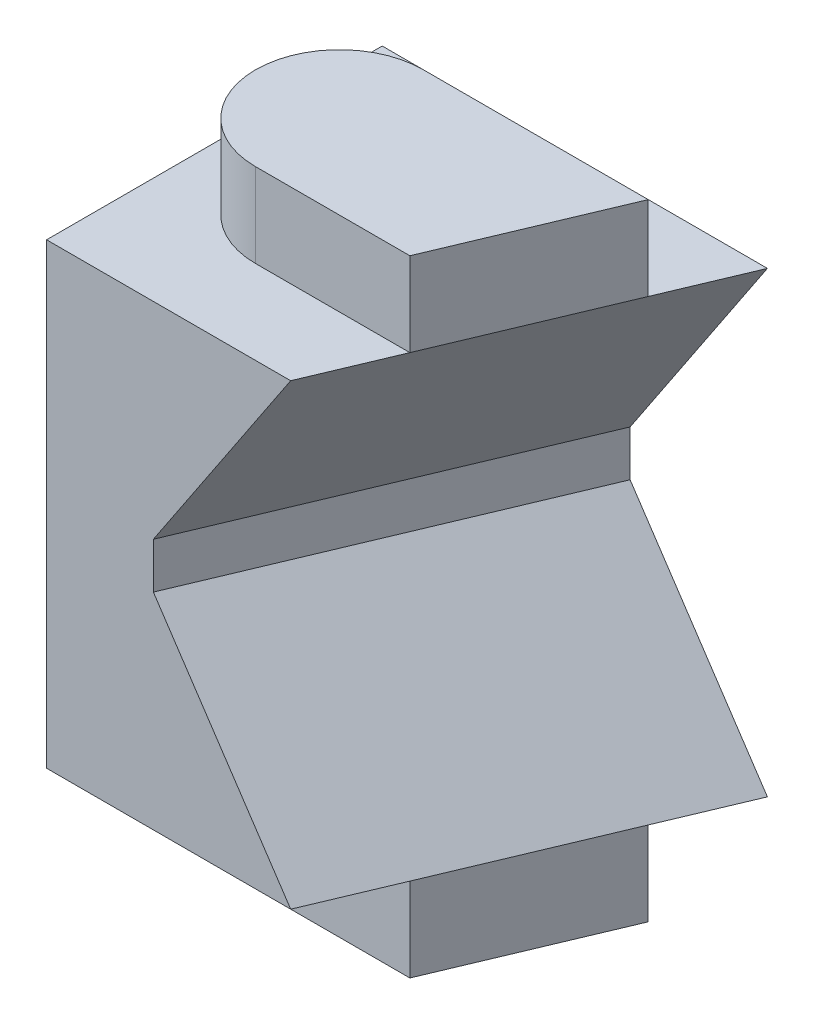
ISO-10303-21;
HEADER;
FILE_DESCRIPTION(('STEP AP214'),'2;1');
FILE_NAME('part.step','',(''),(''),'','','');
FILE_SCHEMA(('AUTOMOTIVE_DESIGN { 1 0 10303 214 1 1 1 1 }'));
ENDSEC;
DATA;
#1=APPLICATION_CONTEXT('core data for automotive mechanical design processes');
#2=APPLICATION_PROTOCOL_DEFINITION('international standard','automotive_design',2000,#1);
#3=PRODUCT_CONTEXT('',#1,'mechanical');
#4=PRODUCT('Part','Part','',(#3));
#5=PRODUCT_RELATED_PRODUCT_CATEGORY('part','',(#4));
#6=PRODUCT_DEFINITION_FORMATION('','',#4);
#7=PRODUCT_DEFINITION_CONTEXT('part definition',#1,'design');
#8=PRODUCT_DEFINITION('design','',#6,#7);
#9=PRODUCT_DEFINITION_SHAPE('','',#8);
#10=(LENGTH_UNIT() NAMED_UNIT(*) SI_UNIT(.MILLI.,.METRE.));
#11=(NAMED_UNIT(*) PLANE_ANGLE_UNIT() SI_UNIT($,.RADIAN.));
#12=(NAMED_UNIT(*) SI_UNIT($,.STERADIAN.) SOLID_ANGLE_UNIT());
#13=UNCERTAINTY_MEASURE_WITH_UNIT(LENGTH_MEASURE(1.E-05),#10,'distance_accuracy_value','');
#14=(GEOMETRIC_REPRESENTATION_CONTEXT(3) GLOBAL_UNCERTAINTY_ASSIGNED_CONTEXT((#13)) GLOBAL_UNIT_ASSIGNED_CONTEXT((#10,
#11,#12)) REPRESENTATION_CONTEXT('',''));
#15=CARTESIAN_POINT('',(0.,0.,0.));
#16=DIRECTION('',(0.,0.,1.));
#17=DIRECTION('',(1.,0.,0.));
#18=AXIS2_PLACEMENT_3D('',#15,#16,#17);
#19=CARTESIAN_POINT('',(15.9999998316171,-15.0000000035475,22.0000000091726));
#20=DIRECTION('',(0.785395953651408,0.523597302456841,0.330150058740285));
#21=DIRECTION('',(-0.554700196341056,0.832050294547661,-4.39613269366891E-13));
#22=AXIS2_PLACEMENT_3D('',#19,#20,#21);
#23=PLANE('',#22);
#24=CARTESIAN_POINT('',(25.2479482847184,-15.0000000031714,1.43924499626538E-09));
#25=CARTESIAN_POINT('',(22.935961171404,-15.0000000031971,5.50000000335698));
#26=B_SPLINE_CURVE_WITH_KNOTS('',1,(#24,#25),.UNSPECIFIED.,.F.,.F.,(2,2),(0.,1.),.UNSPECIFIED.);
#27=CARTESIAN_POINT('',(25.2479482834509,-15.000000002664,4.64784119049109E-10));
#28=VERTEX_POINT('',#27);
#29=CARTESIAN_POINT('',(22.9359611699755,-15.0000000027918,5.50000000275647));
#30=VERTEX_POINT('',#29);
#31=EDGE_CURVE('E205',#28,#30,#26,.T.);
#32=ORIENTED_EDGE('',*,*,#31,.F.);
#33=CARTESIAN_POINT('',(25.2479482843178,-15.0000000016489,-2.24463195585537E-11));
#34=CARTESIAN_POINT('',(16.2479482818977,-1.49999999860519,-1.53148074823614E-11));
#35=B_SPLINE_CURVE_WITH_KNOTS('',1,(#33,#34),.UNSPECIFIED.,.F.,.F.,(2,2),(0.,1.),.UNSPECIFIED.);
#36=CARTESIAN_POINT('',(16.2479482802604,-1.4999996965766,-9.49299120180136E-12));
#37=VERTEX_POINT('',#36);
#38=EDGE_CURVE('E277',#28,#37,#35,.T.);
#39=ORIENTED_EDGE('',*,*,#38,.T.);
#40=CARTESIAN_POINT('',(16.247948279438,-1.49999999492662,2.15064086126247E-12));
#41=CARTESIAN_POINT('',(6.99999982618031,-1.49999999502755,22.0000000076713));
#42=B_SPLINE_CURVE_WITH_KNOTS('',1,(#40,#41),.UNSPECIFIED.,.F.,.F.,(2,2),(0.,1.),.UNSPECIFIED.);
#43=CARTESIAN_POINT('',(6.9999999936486,-1.50000008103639,22.0000000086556));
#44=VERTEX_POINT('',#43);
#45=EDGE_CURVE('E131',#37,#44,#42,.T.);
#46=ORIENTED_EDGE('',*,*,#45,.T.);
#47=CARTESIAN_POINT('',(15.9999998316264,-15.0000000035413,22.0000000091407));
#48=CARTESIAN_POINT('',(6.99999982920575,-1.5000000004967,22.0000000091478));
#49=B_SPLINE_CURVE_WITH_KNOTS('',1,(#47,#48),.UNSPECIFIED.,.F.,.F.,(2,2),(0.,1.),.UNSPECIFIED.);
#50=CARTESIAN_POINT('',(15.9999998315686,-15.0000000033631,22.0000000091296));
#51=VERTEX_POINT('',#50);
#52=EDGE_CURVE('E129',#51,#44,#49,.T.);
#53=ORIENTED_EDGE('',*,*,#52,.F.);
#54=CARTESIAN_POINT('',(18.3119869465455,-15.0000000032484,16.5000000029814));
#55=CARTESIAN_POINT('',(15.9999998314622,-15.000000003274,22.0000000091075));
#56=B_SPLINE_CURVE_WITH_KNOTS('',1,(#54,#55),.UNSPECIFIED.,.F.,.F.,(2,2),(0.,1.),.UNSPECIFIED.);
#57=CARTESIAN_POINT('',(18.3119869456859,-15.0000000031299,16.5000000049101));
#58=VERTEX_POINT('',#57);
#59=EDGE_CURVE('E116',#58,#51,#56,.T.);
#60=ORIENTED_EDGE('',*,*,#59,.F.);
#61=CARTESIAN_POINT('',(22.9359611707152,-15.0000000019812,5.50000000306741));
#62=CARTESIAN_POINT('',(18.3119869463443,-15.0000000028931,16.5000000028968));
#63=B_SPLINE_CURVE_WITH_KNOTS('',1,(#61,#62),.UNSPECIFIED.,.F.,.F.,(2,2),(0.,1.),.UNSPECIFIED.);
#64=EDGE_CURVE('E189',#30,#58,#63,.T.);
#65=ORIENTED_EDGE('',*,*,#64,.F.);
#66=EDGE_LOOP('',(#32,#39,#46,#53,#60,#65));
#67=FACE_BOUND('',#66,.T.);
#68=ADVANCED_FACE('F14',(#67),#23,.T.);
#69=CARTESIAN_POINT('',(4.99999982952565,-15.0000000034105,22.0000000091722));
#70=DIRECTION('',(-1.24066867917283E-11,1.00000000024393,-5.52071956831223E-13));
#71=DIRECTION('',(0.,-5.52016445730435E-13,1.00000000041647));
#72=AXIS2_PLACEMENT_3D('',#69,#70,#71);
#73=PLANE('',#72);
#74=ORIENTED_EDGE('',*,*,#59,.T.);
#75=CARTESIAN_POINT('',(15.9999998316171,-15.000000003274,22.0000000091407));
#76=CARTESIAN_POINT('',(0.390815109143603,-15.0000000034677,22.0000000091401));
#77=B_SPLINE_CURVE_WITH_KNOTS('',1,(#75,#76),.UNSPECIFIED.,.F.,.F.,(2,2),(0.,1.),.UNSPECIFIED.);
#78=CARTESIAN_POINT('',(0.390815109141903,-15.0000000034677,22.0000000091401));
#79=VERTEX_POINT('',#78);
#80=EDGE_CURVE('E120',#51,#79,#77,.T.);
#81=ORIENTED_EDGE('',*,*,#80,.T.);
#82=CARTESIAN_POINT('',(0.390815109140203,-15.0000000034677,22.0000000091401));
#83=CARTESIAN_POINT('',(-1.66666645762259E-07,-15.0000000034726,22.0000000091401));
#84=B_SPLINE_CURVE_WITH_KNOTS('',1,(#82,#83),.UNSPECIFIED.,.F.,.F.,(2,2),(0.,1.),.UNSPECIFIED.);
#85=CARTESIAN_POINT('',(-1.66666645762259E-07,-14.9999998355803,22.0000000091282));
#86=VERTEX_POINT('',#85);
#87=EDGE_CURVE('E139',#79,#86,#84,.T.);
#88=ORIENTED_EDGE('',*,*,#87,.T.);
#89=CARTESIAN_POINT('',(-1.66666645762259E-07,-15.0000000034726,22.0000000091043));
#90=CARTESIAN_POINT('',(-1.66666645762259E-07,-15.0000000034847,-3.71435158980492E-09));
#91=B_SPLINE_CURVE_WITH_KNOTS('',1,(#89,#90),.UNSPECIFIED.,.F.,.F.,(2,2),(0.,1.),.UNSPECIFIED.);
#92=CARTESIAN_POINT('',(0.,-15.0000000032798,-1.25368120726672E-09));
#93=VERTEX_POINT('',#92);
#94=EDGE_CURVE('E126',#86,#93,#91,.T.);
#95=ORIENTED_EDGE('',*,*,#94,.T.);
#96=CARTESIAN_POINT('',(0.390815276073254,-15.0000000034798,-2.33320895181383E-11));
#97=CARTESIAN_POINT('',(-1.66666645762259E-07,-15.0000000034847,-2.33460160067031E-11));
#98=B_SPLINE_CURVE_WITH_KNOTS('',1,(#96,#97),.UNSPECIFIED.,.F.,.F.,(2,2),(0.,1.),.UNSPECIFIED.);
#99=CARTESIAN_POINT('',(0.390815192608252,-15.0000000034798,-2.33320895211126E-11));
#100=VERTEX_POINT('',#99);
#101=EDGE_CURVE('E312',#100,#93,#98,.T.);
#102=ORIENTED_EDGE('',*,*,#101,.F.);
#103=CARTESIAN_POINT('',(25.2479482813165,-15.0000000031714,-2.24463195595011E-11));
#104=CARTESIAN_POINT('',(0.390815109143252,-15.0000000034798,-2.33320895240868E-11));
#105=B_SPLINE_CURVE_WITH_KNOTS('',1,(#103,#104),.UNSPECIFIED.,.F.,.F.,(2,2),(0.,1.),.UNSPECIFIED.);
#106=EDGE_CURVE('E275',#28,#100,#105,.T.);
#107=ORIENTED_EDGE('',*,*,#106,.F.);
#108=ORIENTED_EDGE('',*,*,#31,.T.);
#109=CARTESIAN_POINT('',(8.19540747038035,-15.00000000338,5.50000000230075));
#110=CARTESIAN_POINT('',(22.9359611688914,-15.0000000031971,5.50000000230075));
#111=B_SPLINE_CURVE_WITH_KNOTS('',1,(#109,#110),.UNSPECIFIED.,.F.,.F.,(2,2),(0.,1.),.UNSPECIFIED.);
#112=CARTESIAN_POINT('',(8.1954074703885,-15.00000000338,5.50000000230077));
#113=VERTEX_POINT('',#112);
#114=EDGE_CURVE('E181',#113,#30,#111,.T.);
#115=ORIENTED_EDGE('',*,*,#114,.F.);
#116=CARTESIAN_POINT('',(8.19540747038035,-15.0000000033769,11.000000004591));
#117=DIRECTION('',(-1.24066867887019E-11,1.,-5.52071956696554E-13));
#118=DIRECTION('',(-1.,-1.24066867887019E-11,0.));
#119=AXIS2_PLACEMENT_3D('',#116,#117,#118);
#120=CIRCLE('',#119,5.50000000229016);
#121=CARTESIAN_POINT('',(8.1954074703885,-15.0000000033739,16.5000000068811));
#122=VERTEX_POINT('',#121);
#123=EDGE_CURVE('E179',#113,#122,#120,.T.);
#124=ORIENTED_EDGE('',*,*,#123,.T.);
#125=CARTESIAN_POINT('',(18.3119869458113,-15.0000000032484,16.5000000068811));
#126=CARTESIAN_POINT('',(8.19540747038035,-15.0000000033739,16.5000000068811));
#127=B_SPLINE_CURVE_WITH_KNOTS('',1,(#125,#126),.UNSPECIFIED.,.F.,.F.,(2,2),(0.,1.),.UNSPECIFIED.);
#128=EDGE_CURVE('E123',#58,#122,#127,.T.);
#129=ORIENTED_EDGE('',*,*,#128,.F.);
#130=EDGE_LOOP('',(#74,#81,#88,#95,#102,#107,#108,#115,#124,#129));
#131=FACE_BOUND('',#130,.T.);
#132=ADVANCED_FACE('F118',(#131),#73,.F.);
#133=CARTESIAN_POINT('',(-1.66666645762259E-07,-15.0000000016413,-3.71435173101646E-09));
#134=DIRECTION('',(1.,0.,0.));
#135=DIRECTION('',(0.,0.,-1.));
#136=AXIS2_PLACEMENT_3D('',#133,#134,#135);
#137=PLANE('',#136);
#138=CARTESIAN_POINT('',(-1.66666645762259E-07,15.0000000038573,-1.9731186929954E-09));
#139=CARTESIAN_POINT('',(-1.66666645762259E-07,15.0000000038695,22.0000000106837));
#140=B_SPLINE_CURVE_WITH_KNOTS('',1,(#138,#139),.UNSPECIFIED.,.F.,.F.,(2,2),(0.,1.),.UNSPECIFIED.);
#141=CARTESIAN_POINT('',(0.,14.9999997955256,-6.62229912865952E-10));
#142=VERTEX_POINT('',#141);
#143=CARTESIAN_POINT('',(-1.66666645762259E-07,15.0000000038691,21.9999998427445));
#144=VERTEX_POINT('',#143);
#145=EDGE_CURVE('E369',#142,#144,#140,.T.);
#146=ORIENTED_EDGE('',*,*,#145,.F.);
#147=CARTESIAN_POINT('',(-1.66666645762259E-07,-15.0000000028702,-2.33460160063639E-11));
#148=CARTESIAN_POINT('',(-1.66666645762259E-07,14.9999998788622,-6.78552270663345E-12));
#149=B_SPLINE_CURVE_WITH_KNOTS('',1,(#147,#148),.UNSPECIFIED.,.F.,.F.,(2,2),(0.,1.),.UNSPECIFIED.);
#150=EDGE_CURVE('E322',#93,#142,#149,.T.);
#151=ORIENTED_EDGE('',*,*,#150,.F.);
#152=ORIENTED_EDGE('',*,*,#94,.F.);
#153=CARTESIAN_POINT('',(-1.66666645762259E-07,15.0000000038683,22.0000000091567));
#154=CARTESIAN_POINT('',(-1.66666645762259E-07,-14.999999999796,22.0000000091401));
#155=B_SPLINE_CURVE_WITH_KNOTS('',1,(#153,#154),.UNSPECIFIED.,.F.,.F.,(2,2),(0.,1.),.UNSPECIFIED.);
#156=EDGE_CURVE('E141',#144,#86,#155,.T.);
#157=ORIENTED_EDGE('',*,*,#156,.F.);
#158=EDGE_LOOP('',(#146,#151,#152,#157));
#159=FACE_BOUND('',#158,.T.);
#160=ADVANCED_FACE('F368',(#159),#137,.F.);
#161=CARTESIAN_POINT('',(8.1954074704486,-20.5000000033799,5.50000000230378));
#162=DIRECTION('',(0.,5.52071956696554E-13,1.));
#163=DIRECTION('',(0.,-1.,5.52071956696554E-13));
#164=AXIS2_PLACEMENT_3D('',#161,#162,#163);
#165=PLANE('',#164);
#166=ORIENTED_EDGE('',*,*,#114,.T.);
#167=DIRECTION('',(-1.24066867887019E-11,1.,-5.52071956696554E-13));
#168=VECTOR('',#167,1.);
#169=CARTESIAN_POINT('',(22.9359611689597,-20.5000000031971,5.50000000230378));
#170=LINE('',#169,#168);
#171=CARTESIAN_POINT('',(22.9359611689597,-20.5000000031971,5.50000000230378));
#172=VERTEX_POINT('',#171);
#173=EDGE_CURVE('E186',#172,#30,#170,.T.);
#174=ORIENTED_EDGE('',*,*,#173,.F.);
#175=DIRECTION('',(1.,1.24066905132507E-11,0.));
#176=VECTOR('',#175,1.);
#177=CARTESIAN_POINT('',(8.1954074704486,-20.5000000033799,5.50000000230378));
#178=LINE('',#177,#176);
#179=CARTESIAN_POINT('',(8.1954074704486,-20.5000000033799,5.50000000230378));
#180=VERTEX_POINT('',#179);
#181=EDGE_CURVE('E182',#180,#172,#178,.T.);
#182=ORIENTED_EDGE('',*,*,#181,.F.);
#183=DIRECTION('',(-1.24066867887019E-11,1.,-5.52071956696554E-13));
#184=VECTOR('',#183,1.);
#185=CARTESIAN_POINT('',(8.1954074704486,-20.5000000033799,5.50000000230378));
#186=LINE('',#185,#184);
#187=EDGE_CURVE('E185',#180,#113,#186,.T.);
#188=ORIENTED_EDGE('',*,*,#187,.T.);
#189=EDGE_LOOP('',(#166,#174,#182,#188));
#190=FACE_BOUND('',#189,.T.);
#191=ADVANCED_FACE('F269',(#190),#165,.F.);
#192=CARTESIAN_POINT('',(18.3119869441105,-20.5000000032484,16.5000000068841));
#193=DIRECTION('',(-0.921863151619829,-1.16512038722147E-11,-0.387515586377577));
#194=DIRECTION('',(-0.387515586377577,0.,0.921863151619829));
#195=AXIS2_PLACEMENT_3D('',#192,#193,#194);
#196=PLANE('',#195);
#197=ORIENTED_EDGE('',*,*,#64,.T.);
#198=DIRECTION('',(-1.24066867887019E-11,1.,-5.52071956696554E-13));
#199=VECTOR('',#198,1.);
#200=CARTESIAN_POINT('',(18.3119869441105,-20.5000000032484,16.5000000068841));
#201=LINE('',#200,#199);
#202=CARTESIAN_POINT('',(18.3119869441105,-20.5000000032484,16.5000000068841));
#203=VERTEX_POINT('',#202);
#204=EDGE_CURVE('E194',#203,#58,#201,.T.);
#205=ORIENTED_EDGE('',*,*,#204,.F.);
#206=DIRECTION('',(-0.387515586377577,-4.29873490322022E-12,0.921863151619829));
#207=VECTOR('',#206,1.);
#208=CARTESIAN_POINT('',(18.3119869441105,-20.5000000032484,16.5000000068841));
#209=LINE('',#208,#207);
#210=EDGE_CURVE('E190',#172,#203,#209,.T.);
#211=ORIENTED_EDGE('',*,*,#210,.F.);
#212=ORIENTED_EDGE('',*,*,#173,.T.);
#213=EDGE_LOOP('',(#197,#205,#211,#212));
#214=FACE_BOUND('',#213,.T.);
#215=ADVANCED_FACE('F264',(#214),#196,.F.);
#216=CARTESIAN_POINT('',(8.1954074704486,-20.500000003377,11.000000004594));
#217=DIRECTION('',(-1.24066867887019E-11,1.,-5.52071956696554E-13));
#218=DIRECTION('',(-1.,-1.24066867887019E-11,0.));
#219=AXIS2_PLACEMENT_3D('',#216,#217,#218);
#220=CYLINDRICAL_SURFACE('',#219,5.50000000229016);
#221=ORIENTED_EDGE('',*,*,#123,.F.);
#222=ORIENTED_EDGE('',*,*,#187,.F.);
#223=CARTESIAN_POINT('',(8.1954074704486,-20.500000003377,11.000000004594));
#224=DIRECTION('',(1.24066867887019E-11,-1.,5.52071956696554E-13));
#225=DIRECTION('',(1.,1.24066867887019E-11,0.));
#226=AXIS2_PLACEMENT_3D('',#223,#224,#225);
#227=CIRCLE('',#226,5.50000000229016);
#228=CARTESIAN_POINT('',(8.1954074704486,-20.5000000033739,16.5000000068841));
#229=VERTEX_POINT('',#228);
#230=EDGE_CURVE('E193',#229,#180,#227,.T.);
#231=ORIENTED_EDGE('',*,*,#230,.F.);
#232=DIRECTION('',(-1.24066867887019E-11,1.,-5.52071956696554E-13));
#233=VECTOR('',#232,1.);
#234=CARTESIAN_POINT('',(8.1954074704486,-20.5000000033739,16.5000000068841));
#235=LINE('',#234,#233);
#236=EDGE_CURVE('E197',#229,#122,#235,.T.);
#237=ORIENTED_EDGE('',*,*,#236,.T.);
#238=EDGE_LOOP('',(#221,#222,#231,#237));
#239=FACE_BOUND('',#238,.T.);
#240=ADVANCED_FACE('F272',(#239),#220,.T.);
#241=CARTESIAN_POINT('',(8.1954074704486,-20.5000000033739,16.5000000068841));
#242=DIRECTION('',(0.,-5.52071956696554E-13,-1.));
#243=DIRECTION('',(0.,1.,-5.52071956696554E-13));
#244=AXIS2_PLACEMENT_3D('',#241,#242,#243);
#245=PLANE('',#244);
#246=ORIENTED_EDGE('',*,*,#128,.T.);
#247=ORIENTED_EDGE('',*,*,#236,.F.);
#248=DIRECTION('',(-1.,-1.240678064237E-11,0.));
#249=VECTOR('',#248,1.);
#250=CARTESIAN_POINT('',(8.1954074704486,-20.5000000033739,16.5000000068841));
#251=LINE('',#250,#249);
#252=EDGE_CURVE('E200',#203,#229,#251,.T.);
#253=ORIENTED_EDGE('',*,*,#252,.F.);
#254=ORIENTED_EDGE('',*,*,#204,.T.);
#255=EDGE_LOOP('',(#246,#247,#253,#254));
#256=FACE_BOUND('',#255,.T.);
#257=ADVANCED_FACE('F260',(#256),#245,.F.);
#258=CARTESIAN_POINT('',(8.1954074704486,-20.500000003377,11.000000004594));
#259=DIRECTION('',(1.24066867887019E-11,-1.,5.52071956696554E-13));
#260=DIRECTION('',(1.,1.24066867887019E-11,0.));
#261=AXIS2_PLACEMENT_3D('',#258,#259,#260);
#262=PLANE('',#261);
#263=ORIENTED_EDGE('',*,*,#230,.T.);
#264=ORIENTED_EDGE('',*,*,#181,.T.);
#265=ORIENTED_EDGE('',*,*,#210,.T.);
#266=ORIENTED_EDGE('',*,*,#252,.T.);
#267=EDGE_LOOP('',(#263,#264,#265,#266));
#268=FACE_BOUND('',#267,.T.);
#269=ADVANCED_FACE('F266',(#268),#262,.T.);
#270=CARTESIAN_POINT('',(15.9999998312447,15.0000000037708,22.0000000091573));
#271=DIRECTION('',(0.,-5.52016445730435E-13,1.00000000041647));
#272=DIRECTION('',(1.00000000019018,-1.24070198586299E-11,0.));
#273=AXIS2_PLACEMENT_3D('',#270,#271,#272);
#274=PLANE('',#273);
#275=CARTESIAN_POINT('',(15.9999998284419,15.0000000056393,22.0000000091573));
#276=CARTESIAN_POINT('',(6.9999998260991,1.50000000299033,22.0000000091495));
#277=B_SPLINE_CURVE_WITH_KNOTS('',1,(#275,#276),.UNSPECIFIED.,.F.,.F.,(2,2),(0.,1.),.UNSPECIFIED.);
#278=CARTESIAN_POINT('',(15.999999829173,15.0000000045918,22.00000000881));
#279=VERTEX_POINT('',#278);
#280=CARTESIAN_POINT('',(6.9999999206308,1.50000014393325,22.0000000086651));
#281=VERTEX_POINT('',#280);
#282=EDGE_CURVE('E412',#279,#281,#277,.T.);
#283=ORIENTED_EDGE('',*,*,#282,.F.);
#284=CARTESIAN_POINT('',(15.9999998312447,15.000000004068,22.0000000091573));
#285=CARTESIAN_POINT('',(0.390815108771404,15.0000000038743,22.0000000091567));
#286=B_SPLINE_CURVE_WITH_KNOTS('',1,(#284,#285),.UNSPECIFIED.,.F.,.F.,(2,2),(0.,1.),.UNSPECIFIED.);
#287=CARTESIAN_POINT('',(0.390815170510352,15.0000000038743,22.0000000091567));
#288=VERTEX_POINT('',#287);
#289=EDGE_CURVE('E165',#279,#288,#286,.T.);
#290=ORIENTED_EDGE('',*,*,#289,.T.);
#291=CARTESIAN_POINT('',(0.390815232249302,15.0000000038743,22.0000000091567));
#292=CARTESIAN_POINT('',(-1.66666645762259E-07,15.0000000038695,22.0000000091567));
#293=B_SPLINE_CURVE_WITH_KNOTS('',1,(#291,#292),.UNSPECIFIED.,.F.,.F.,(2,2),(0.,1.),.UNSPECIFIED.);
#294=EDGE_CURVE('E363',#288,#144,#293,.T.);
#295=ORIENTED_EDGE('',*,*,#294,.T.);
#296=ORIENTED_EDGE('',*,*,#156,.T.);
#297=ORIENTED_EDGE('',*,*,#87,.F.);
#298=ORIENTED_EDGE('',*,*,#80,.F.);
#299=ORIENTED_EDGE('',*,*,#52,.T.);
#300=CARTESIAN_POINT('',(6.9999998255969,1.50000000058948,22.0000000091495));
#301=CARTESIAN_POINT('',(6.99999982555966,-1.50000000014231,22.0000000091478));
#302=B_SPLINE_CURVE_WITH_KNOTS('',1,(#300,#301),.UNSPECIFIED.,.F.,.F.,(2,2),(0.,1.),.UNSPECIFIED.);
#303=EDGE_CURVE('E134',#281,#44,#302,.T.);
#304=ORIENTED_EDGE('',*,*,#303,.F.);
#305=EDGE_LOOP('',(#283,#290,#295,#296,#297,#298,#299,#304));
#306=FACE_BOUND('',#305,.T.);
#307=ADVANCED_FACE('F137',(#306),#274,.T.);
#308=CARTESIAN_POINT('',(16.247948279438,-1.50000000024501,2.15075204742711E-12));
#309=DIRECTION('',(-0.921863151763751,1.1651633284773E-11,-0.387515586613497));
#310=DIRECTION('',(-0.387515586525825,4.2988952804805E-12,0.921863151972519));
#311=AXIS2_PLACEMENT_3D('',#308,#309,#310);
#312=PLANE('',#311);
#313=ORIENTED_EDGE('',*,*,#303,.T.);
#314=ORIENTED_EDGE('',*,*,#45,.F.);
#315=CARTESIAN_POINT('',(16.2479482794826,1.50000000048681,-1.3658758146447E-11));
#316=CARTESIAN_POINT('',(16.2479482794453,-1.50000000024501,-1.53148074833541E-11));
#317=B_SPLINE_CURVE_WITH_KNOTS('',1,(#315,#316),.UNSPECIFIED.,.F.,.F.,(2,2),(0.,1.),.UNSPECIFIED.);
#318=CARTESIAN_POINT('',(16.2479482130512,1.5000000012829,1.57321491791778E-07));
#319=VERTEX_POINT('',#318);
#320=EDGE_CURVE('E280',#319,#37,#317,.T.);
#321=ORIENTED_EDGE('',*,*,#320,.F.);
#322=CARTESIAN_POINT('',(6.9999998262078,1.50000000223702,22.0000000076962));
#323=CARTESIAN_POINT('',(16.2479482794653,1.50000000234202,2.75628714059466E-11));
#324=B_SPLINE_CURVE_WITH_KNOTS('',1,(#322,#323),.UNSPECIFIED.,.F.,.F.,(2,2),(0.,1.),.UNSPECIFIED.);
#325=EDGE_CURVE('E414',#281,#319,#324,.T.);
#326=ORIENTED_EDGE('',*,*,#325,.F.);
#327=EDGE_LOOP('',(#313,#314,#321,#326));
#328=FACE_BOUND('',#327,.T.);
#329=ADVANCED_FACE('F517',(#328),#312,.F.);
#330=CARTESIAN_POINT('',(4.99999982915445,15.0000000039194,-6.6073504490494E-12));
#331=DIRECTION('',(0.,5.52016445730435E-13,-1.00000000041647));
#332=DIRECTION('',(-1.00000000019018,1.24070198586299E-11,0.));
#333=AXIS2_PLACEMENT_3D('',#330,#331,#332);
#334=PLANE('',#333);
#335=CARTESIAN_POINT('',(25.2479482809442,15.000000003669,-5.88581621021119E-12));
#336=CARTESIAN_POINT('',(16.2479482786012,1.50000000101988,-1.36590445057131E-11));
#337=B_SPLINE_CURVE_WITH_KNOTS('',1,(#335,#336),.UNSPECIFIED.,.F.,.F.,(2,2),(0.,1.),.UNSPECIFIED.);
#338=CARTESIAN_POINT('',(25.2479482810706,15.0000000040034,3.3760617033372E-11));
#339=VERTEX_POINT('',#338);
#340=EDGE_CURVE('E285',#339,#319,#337,.T.);
#341=ORIENTED_EDGE('',*,*,#340,.T.);
#342=ORIENTED_EDGE('',*,*,#320,.T.);
#343=ORIENTED_EDGE('',*,*,#38,.F.);
#344=ORIENTED_EDGE('',*,*,#106,.T.);
#345=ORIENTED_EDGE('',*,*,#101,.T.);
#346=ORIENTED_EDGE('',*,*,#150,.T.);
#347=CARTESIAN_POINT('',(0.390815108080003,15.0000000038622,-6.77159615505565E-12));
#348=CARTESIAN_POINT('',(-1.66666645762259E-07,15.0000000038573,-6.78552263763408E-12));
#349=B_SPLINE_CURVE_WITH_KNOTS('',1,(#347,#348),.UNSPECIFIED.,.F.,.F.,(2,2),(0.,1.),.UNSPECIFIED.);
#350=CARTESIAN_POINT('',(0.390815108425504,15.0000000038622,-6.77159615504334E-12));
#351=VERTEX_POINT('',#350);
#352=EDGE_CURVE('E371',#351,#142,#349,.T.);
#353=ORIENTED_EDGE('',*,*,#352,.F.);
#354=CARTESIAN_POINT('',(25.2479482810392,15.0000000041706,-5.88582619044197E-12));
#355=CARTESIAN_POINT('',(0.390815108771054,15.0000000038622,-6.77159615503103E-12));
#356=B_SPLINE_CURVE_WITH_KNOTS('',1,(#354,#355),.UNSPECIFIED.,.F.,.F.,(2,2),(0.,1.),.UNSPECIFIED.);
#357=EDGE_CURVE('E331',#339,#351,#356,.T.);
#358=ORIENTED_EDGE('',*,*,#357,.F.);
#359=EDGE_LOOP('',(#341,#342,#343,#344,#345,#346,#353,#358));
#360=FACE_BOUND('',#359,.T.);
#361=ADVANCED_FACE('F283',(#360),#334,.T.);
#362=CARTESIAN_POINT('',(4.99999982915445,15.0000000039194,-6.6073504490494E-12));
#363=DIRECTION('',(-1.24066867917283E-11,1.00000000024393,-5.52071956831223E-13));
#364=DIRECTION('',(0.,-5.52016445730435E-13,1.00000000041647));
#365=AXIS2_PLACEMENT_3D('',#362,#363,#364);
#366=PLANE('',#365);
#367=CARTESIAN_POINT('',(8.19540747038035,15.0000000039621,5.50000000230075));
#368=CARTESIAN_POINT('',(22.9359611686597,15.0000000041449,5.50000000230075));
#369=B_SPLINE_CURVE_WITH_KNOTS('',1,(#367,#368),.UNSPECIFIED.,.F.,.F.,(2,2),(0.,1.),.UNSPECIFIED.);
#370=CARTESIAN_POINT('',(8.1954074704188,15.0000000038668,5.50000000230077));
#371=VERTEX_POINT('',#370);
#372=CARTESIAN_POINT('',(22.9359611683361,15.0000000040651,5.5000000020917));
#373=VERTEX_POINT('',#372);
#374=EDGE_CURVE('E421',#371,#373,#369,.T.);
#375=ORIENTED_EDGE('',*,*,#374,.T.);
#376=CARTESIAN_POINT('',(22.9359611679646,15.0000000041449,5.50000000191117));
#377=CARTESIAN_POINT('',(25.2479482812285,15.0000000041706,1.13053493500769E-10));
#378=B_SPLINE_CURVE_WITH_KNOTS('',1,(#376,#377),.UNSPECIFIED.,.F.,.F.,(2,2),(0.,1.),.UNSPECIFIED.);
#379=EDGE_CURVE('E23',#373,#339,#378,.T.);
#380=ORIENTED_EDGE('',*,*,#379,.T.);
#381=ORIENTED_EDGE('',*,*,#357,.T.);
#382=ORIENTED_EDGE('',*,*,#352,.T.);
#383=ORIENTED_EDGE('',*,*,#145,.T.);
#384=ORIENTED_EDGE('',*,*,#294,.F.);
#385=ORIENTED_EDGE('',*,*,#289,.F.);
#386=CARTESIAN_POINT('',(15.9999998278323,15.000000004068,22.0000000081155));
#387=CARTESIAN_POINT('',(18.3119869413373,15.0000000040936,16.5000000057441));
#388=B_SPLINE_CURVE_WITH_KNOTS('',1,(#386,#387),.UNSPECIFIED.,.F.,.F.,(2,2),(0.,1.),.UNSPECIFIED.);
#389=CARTESIAN_POINT('',(18.3119869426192,15.0000000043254,16.500000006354));
#390=VERTEX_POINT('',#389);
#391=EDGE_CURVE('E32',#279,#390,#388,.T.);
#392=ORIENTED_EDGE('',*,*,#391,.T.);
#393=CARTESIAN_POINT('',(18.311986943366,15.0000000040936,16.5000000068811));
#394=CARTESIAN_POINT('',(8.19540747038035,15.0000000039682,16.5000000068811));
#395=B_SPLINE_CURVE_WITH_KNOTS('',1,(#393,#394),.UNSPECIFIED.,.F.,.F.,(2,2),(0.,1.),.UNSPECIFIED.);
#396=CARTESIAN_POINT('',(8.1954074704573,15.0000000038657,16.5000000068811));
#397=VERTEX_POINT('',#396);
#398=EDGE_CURVE('E171',#390,#397,#395,.T.);
#399=ORIENTED_EDGE('',*,*,#398,.T.);
#400=CARTESIAN_POINT('',(8.19540747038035,15.0000000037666,11.000000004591));
#401=DIRECTION('',(-1.24066867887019E-11,-1.,-5.52071956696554E-13));
#402=DIRECTION('',(1.,-1.24066867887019E-11,0.));
#403=AXIS2_PLACEMENT_3D('',#400,#401,#402);
#404=CIRCLE('',#403,5.50000000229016);
#405=EDGE_CURVE('E159',#397,#371,#404,.T.);
#406=ORIENTED_EDGE('',*,*,#405,.T.);
#407=EDGE_LOOP('',(#375,#380,#381,#382,#383,#384,#385,#392,#399,#406));
#408=FACE_BOUND('',#407,.T.);
#409=ADVANCED_FACE('F375',(#408),#366,.T.);
#410=CARTESIAN_POINT('',(8.1954074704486,20.500000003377,11.000000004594));
#411=DIRECTION('',(-1.24066867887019E-11,-1.,-5.52071956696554E-13));
#412=DIRECTION('',(1.,-1.24066867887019E-11,0.));
#413=AXIS2_PLACEMENT_3D('',#410,#411,#412);
#414=CYLINDRICAL_SURFACE('',#413,5.50000000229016);
#415=ORIENTED_EDGE('',*,*,#405,.F.);
#416=DIRECTION('',(-1.24066867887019E-11,-1.,-5.52071956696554E-13));
#417=VECTOR('',#416,1.);
#418=CARTESIAN_POINT('',(8.1954074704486,20.5000000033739,16.5000000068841));
#419=LINE('',#418,#417);
#420=CARTESIAN_POINT('',(8.1954074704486,20.5000000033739,16.5000000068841));
#421=VERTEX_POINT('',#420);
#422=EDGE_CURVE('E164',#421,#397,#419,.T.);
#423=ORIENTED_EDGE('',*,*,#422,.F.);
#424=CARTESIAN_POINT('',(8.1954074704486,20.500000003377,11.000000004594));
#425=DIRECTION('',(-1.24066867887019E-11,-1.,-5.52071956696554E-13));
#426=DIRECTION('',(1.,-1.24066867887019E-11,0.));
#427=AXIS2_PLACEMENT_3D('',#424,#425,#426);
#428=CIRCLE('',#427,5.50000000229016);
#429=CARTESIAN_POINT('',(8.1954074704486,20.5000000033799,5.50000000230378));
#430=VERTEX_POINT('',#429);
#431=EDGE_CURVE('E172',#421,#430,#428,.T.);
#432=ORIENTED_EDGE('',*,*,#431,.T.);
#433=DIRECTION('',(-1.24066867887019E-11,-1.,-5.52071956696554E-13));
#434=VECTOR('',#433,1.);
#435=CARTESIAN_POINT('',(8.1954074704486,20.5000000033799,5.50000000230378));
#436=LINE('',#435,#434);
#437=EDGE_CURVE('E168',#430,#371,#436,.T.);
#438=ORIENTED_EDGE('',*,*,#437,.T.);
#439=EDGE_LOOP('',(#415,#423,#432,#438));
#440=FACE_BOUND('',#439,.T.);
#441=ADVANCED_FACE('F510',(#440),#414,.T.);
#442=CARTESIAN_POINT('',(8.1954074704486,20.5000000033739,16.5000000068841));
#443=DIRECTION('',(0.,-5.52071956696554E-13,1.));
#444=DIRECTION('',(0.,-1.,-5.52071956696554E-13));
#445=AXIS2_PLACEMENT_3D('',#442,#443,#444);
#446=PLANE('',#445);
#447=ORIENTED_EDGE('',*,*,#398,.F.);
#448=DIRECTION('',(-1.24066867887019E-11,-1.,-5.52071956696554E-13));
#449=VECTOR('',#448,1.);
#450=CARTESIAN_POINT('',(18.3119869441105,20.5000000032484,16.5000000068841));
#451=LINE('',#450,#449);
#452=CARTESIAN_POINT('',(18.3119869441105,20.5000000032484,16.5000000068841));
#453=VERTEX_POINT('',#452);
#454=EDGE_CURVE('E475',#453,#390,#451,.T.);
#455=ORIENTED_EDGE('',*,*,#454,.F.);
#456=DIRECTION('',(-1.,1.240678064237E-11,0.));
#457=VECTOR('',#456,1.);
#458=CARTESIAN_POINT('',(8.1954074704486,20.5000000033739,16.5000000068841));
#459=LINE('',#458,#457);
#460=EDGE_CURVE('E471',#453,#421,#459,.T.);
#461=ORIENTED_EDGE('',*,*,#460,.T.);
#462=ORIENTED_EDGE('',*,*,#422,.T.);
#463=EDGE_LOOP('',(#447,#455,#461,#462));
#464=FACE_BOUND('',#463,.T.);
#465=ADVANCED_FACE('F506',(#464),#446,.T.);
#466=CARTESIAN_POINT('',(18.3119869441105,20.5000000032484,16.5000000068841));
#467=DIRECTION('',(0.921863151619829,-1.16512038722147E-11,0.387515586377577));
#468=DIRECTION('',(0.387515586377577,0.,-0.921863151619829));
#469=AXIS2_PLACEMENT_3D('',#466,#467,#468);
#470=PLANE('',#469);
#471=CARTESIAN_POINT('',(22.9359611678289,15.0000000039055,5.50000000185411));
#472=CARTESIAN_POINT('',(18.3119869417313,15.000000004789,16.5000000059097));
#473=B_SPLINE_CURVE_WITH_KNOTS('',1,(#471,#472),.UNSPECIFIED.,.F.,.F.,(2,2),(0.,1.),.UNSPECIFIED.);
#474=EDGE_CURVE('E9',#373,#390,#473,.T.);
#475=ORIENTED_EDGE('',*,*,#474,.F.);
#476=DIRECTION('',(-1.24066867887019E-11,-1.,-5.52071956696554E-13));
#477=VECTOR('',#476,1.);
#478=CARTESIAN_POINT('',(22.9359611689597,20.5000000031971,5.50000000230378));
#479=LINE('',#478,#477);
#480=CARTESIAN_POINT('',(22.9359611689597,20.5000000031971,5.50000000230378));
#481=VERTEX_POINT('',#480);
#482=EDGE_CURVE('E474',#481,#373,#479,.T.);
#483=ORIENTED_EDGE('',*,*,#482,.F.);
#484=DIRECTION('',(-0.387515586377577,4.29873490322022E-12,0.921863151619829));
#485=VECTOR('',#484,1.);
#486=CARTESIAN_POINT('',(18.3119869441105,20.5000000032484,16.5000000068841));
#487=LINE('',#486,#485);
#488=EDGE_CURVE('E476',#481,#453,#487,.T.);
#489=ORIENTED_EDGE('',*,*,#488,.T.);
#490=ORIENTED_EDGE('',*,*,#454,.T.);
#491=EDGE_LOOP('',(#475,#483,#489,#490));
#492=FACE_BOUND('',#491,.T.);
#493=ADVANCED_FACE('F501',(#492),#470,.T.);
#494=CARTESIAN_POINT('',(8.1954074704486,20.5000000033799,5.50000000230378));
#495=DIRECTION('',(0.,5.52071956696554E-13,-1.));
#496=DIRECTION('',(0.,1.,5.52071956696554E-13));
#497=AXIS2_PLACEMENT_3D('',#494,#495,#496);
#498=PLANE('',#497);
#499=ORIENTED_EDGE('',*,*,#374,.F.);
#500=ORIENTED_EDGE('',*,*,#437,.F.);
#501=DIRECTION('',(1.,-1.24066905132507E-11,0.));
#502=VECTOR('',#501,1.);
#503=CARTESIAN_POINT('',(8.1954074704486,20.5000000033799,5.50000000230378));
#504=LINE('',#503,#502);
#505=EDGE_CURVE('E418',#430,#481,#504,.T.);
#506=ORIENTED_EDGE('',*,*,#505,.T.);
#507=ORIENTED_EDGE('',*,*,#482,.T.);
#508=EDGE_LOOP('',(#499,#500,#506,#507));
#509=FACE_BOUND('',#508,.T.);
#510=ADVANCED_FACE('F516',(#509),#498,.T.);
#511=CARTESIAN_POINT('',(8.1954074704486,20.500000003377,11.000000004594));
#512=DIRECTION('',(1.24066867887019E-11,1.,5.52071956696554E-13));
#513=DIRECTION('',(1.,-1.24066867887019E-11,0.));
#514=AXIS2_PLACEMENT_3D('',#511,#512,#513);
#515=PLANE('',#514);
#516=ORIENTED_EDGE('',*,*,#431,.F.);
#517=ORIENTED_EDGE('',*,*,#460,.F.);
#518=ORIENTED_EDGE('',*,*,#488,.F.);
#519=ORIENTED_EDGE('',*,*,#505,.F.);
#520=EDGE_LOOP('',(#516,#517,#518,#519));
#521=FACE_BOUND('',#520,.T.);
#522=ADVANCED_FACE('F529',(#521),#515,.T.);
#523=CARTESIAN_POINT('',(25.2479482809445,15.0000000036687,-7.38064766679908E-12));
#524=DIRECTION('',(0.785395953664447,-0.523597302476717,0.330150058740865));
#525=DIRECTION('',(0.554700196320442,0.83205029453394,-4.79190809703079E-13));
#526=AXIS2_PLACEMENT_3D('',#523,#524,#525);
#527=PLANE('',#526);
#528=ORIENTED_EDGE('',*,*,#391,.F.);
#529=ORIENTED_EDGE('',*,*,#282,.T.);
#530=ORIENTED_EDGE('',*,*,#325,.T.);
#531=ORIENTED_EDGE('',*,*,#340,.F.);
#532=ORIENTED_EDGE('',*,*,#379,.F.);
#533=ORIENTED_EDGE('',*,*,#474,.T.);
#534=EDGE_LOOP('',(#528,#529,#530,#531,#532,#533));
#535=FACE_BOUND('',#534,.T.);
#536=ADVANCED_FACE('F416',(#535),#527,.T.);
#537=CLOSED_SHELL('',(#68,#132,#160,#191,#215,#240,#257,#269,#307,#329,#361,#409,#441,#465,#493,
#510,#522,#536));
#538=MANIFOLD_SOLID_BREP('B1',#537);
#539=ADVANCED_BREP_SHAPE_REPRESENTATION('',(#18,#538),#14);
#540=SHAPE_DEFINITION_REPRESENTATION(#9,#539);
ENDSEC;
END-ISO-10303-21;
